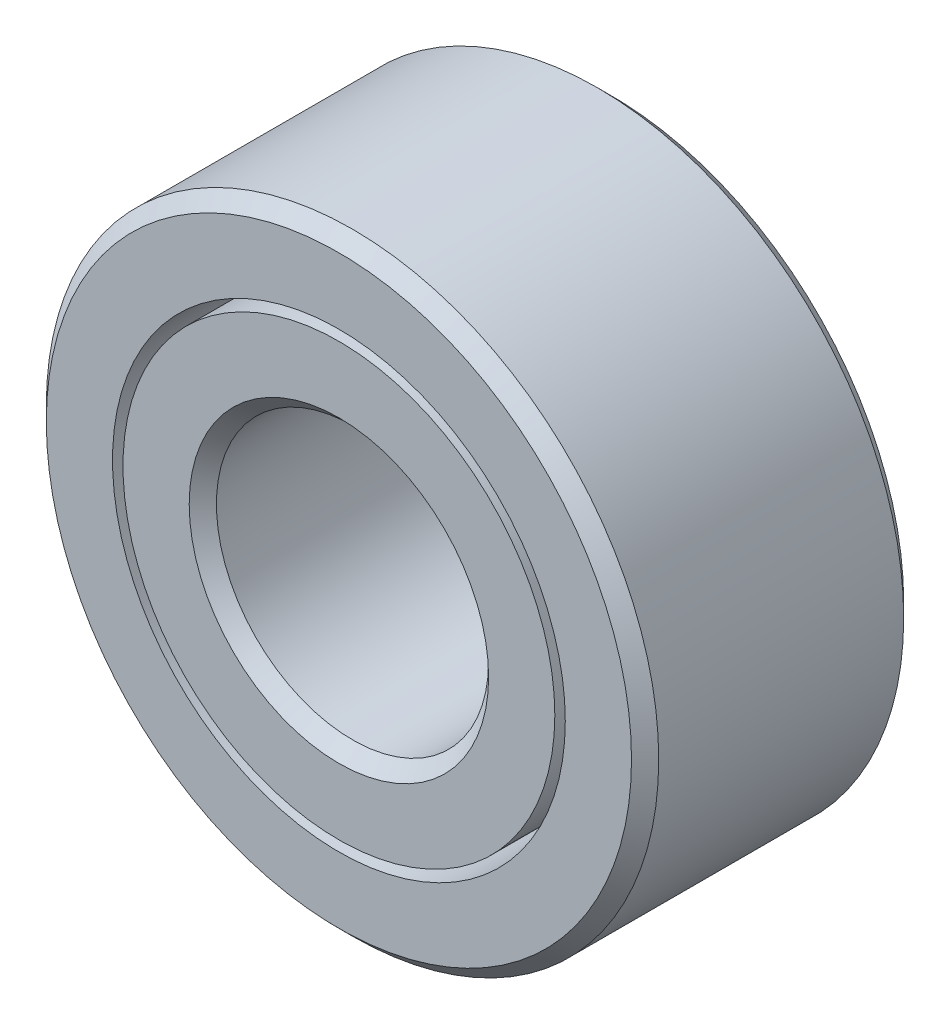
ISO-10303-21;
HEADER;
FILE_DESCRIPTION(('STEP AP214'),'2;1');
FILE_NAME('part.step','',(''),(''),'','','');
FILE_SCHEMA(('AUTOMOTIVE_DESIGN { 1 0 10303 214 1 1 1 1 }'));
ENDSEC;
DATA;
#1=APPLICATION_CONTEXT('core data for automotive mechanical design processes');
#2=APPLICATION_PROTOCOL_DEFINITION('international standard','automotive_design',2000,#1);
#3=PRODUCT_CONTEXT('',#1,'mechanical');
#4=PRODUCT('Part','Part','',(#3));
#5=PRODUCT_RELATED_PRODUCT_CATEGORY('part','',(#4));
#6=PRODUCT_DEFINITION_FORMATION('','',#4);
#7=PRODUCT_DEFINITION_CONTEXT('part definition',#1,'design');
#8=PRODUCT_DEFINITION('design','',#6,#7);
#9=PRODUCT_DEFINITION_SHAPE('','',#8);
#10=(LENGTH_UNIT() NAMED_UNIT(*) SI_UNIT(.MILLI.,.METRE.));
#11=(NAMED_UNIT(*) PLANE_ANGLE_UNIT() SI_UNIT($,.RADIAN.));
#12=(NAMED_UNIT(*) SI_UNIT($,.STERADIAN.) SOLID_ANGLE_UNIT());
#13=UNCERTAINTY_MEASURE_WITH_UNIT(LENGTH_MEASURE(1.E-05),#10,'distance_accuracy_value','');
#14=(GEOMETRIC_REPRESENTATION_CONTEXT(3) GLOBAL_UNCERTAINTY_ASSIGNED_CONTEXT((#13)) GLOBAL_UNIT_ASSIGNED_CONTEXT((#10,
#11,#12)) REPRESENTATION_CONTEXT('',''));
#15=CARTESIAN_POINT('',(0.,0.,0.));
#16=DIRECTION('',(0.,0.,1.));
#17=DIRECTION('',(1.,0.,0.));
#18=AXIS2_PLACEMENT_3D('',#15,#16,#17);
#19=CARTESIAN_POINT('',(-1.2437211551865,3.0026084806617,0.));
#20=DIRECTION('',(0.,0.,1.));
#21=DIRECTION('',(-0.382683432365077,0.923879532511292,0.));
#22=AXIS2_PLACEMENT_3D('',#19,#20,#21);
#23=SPHERICAL_SURFACE('',#22,0.5);
#24=CARTESIAN_POINT('',(-1.2437211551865,3.0026084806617,0.5));
#25=VERTEX_POINT('',#24);
#26=VERTEX_LOOP('',#25);
#27=FACE_BOUND('',#26,.T.);
#28=ADVANCED_FACE('F41',(#27),#23,.T.);
#29=CLOSED_SHELL('',(#28));
#30=MANIFOLD_SOLID_BREP('B2',#29);
#31=CARTESIAN_POINT('',(-2.29809703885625,2.29809703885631,0.));
#32=DIRECTION('',(0.,0.,1.));
#33=DIRECTION('',(-0.707106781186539,0.707106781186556,0.));
#34=AXIS2_PLACEMENT_3D('',#31,#32,#33);
#35=SPHERICAL_SURFACE('',#34,0.5);
#36=CARTESIAN_POINT('',(-2.29809703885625,2.29809703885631,0.5));
#37=VERTEX_POINT('',#36);
#38=VERTEX_LOOP('',#37);
#39=FACE_BOUND('',#38,.T.);
#40=ADVANCED_FACE('F61',(#39),#35,.T.);
#41=CLOSED_SHELL('',(#40));
#42=MANIFOLD_SOLID_BREP('B6',#41);
#43=CARTESIAN_POINT('',(-3.00260848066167,1.24372115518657,0.));
#44=DIRECTION('',(0.,0.,1.));
#45=DIRECTION('',(-0.923879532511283,0.3826834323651,0.));
#46=AXIS2_PLACEMENT_3D('',#43,#44,#45);
#47=SPHERICAL_SURFACE('',#46,0.5);
#48=CARTESIAN_POINT('',(-3.00260848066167,1.24372115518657,0.5));
#49=VERTEX_POINT('',#48);
#50=VERTEX_LOOP('',#49);
#51=FACE_BOUND('',#50,.T.);
#52=ADVANCED_FACE('F81',(#51),#47,.T.);
#53=CLOSED_SHELL('',(#52));
#54=MANIFOLD_SOLID_BREP('B37',#53);
#55=CARTESIAN_POINT('',(-3.25,0.,0.));
#56=DIRECTION('',(0.,0.,1.));
#57=DIRECTION('',(-1.,0.,0.));
#58=AXIS2_PLACEMENT_3D('',#55,#56,#57);
#59=SPHERICAL_SURFACE('',#58,0.5);
#60=CARTESIAN_POINT('',(-3.25,0.,0.5));
#61=VERTEX_POINT('',#60);
#62=VERTEX_LOOP('',#61);
#63=FACE_BOUND('',#62,.T.);
#64=ADVANCED_FACE('F101',(#63),#59,.T.);
#65=CLOSED_SHELL('',(#64));
#66=MANIFOLD_SOLID_BREP('B57',#65);
#67=CARTESIAN_POINT('',(-3.00260848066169,-1.24372115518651,0.));
#68=DIRECTION('',(0.,0.,1.));
#69=DIRECTION('',(-0.923879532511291,-0.382683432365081,0.));
#70=AXIS2_PLACEMENT_3D('',#67,#68,#69);
#71=SPHERICAL_SURFACE('',#70,0.5);
#72=CARTESIAN_POINT('',(-3.00260848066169,-1.24372115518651,0.5));
#73=VERTEX_POINT('',#72);
#74=VERTEX_LOOP('',#73);
#75=FACE_BOUND('',#74,.T.);
#76=ADVANCED_FACE('F121',(#75),#71,.T.);
#77=CLOSED_SHELL('',(#76));
#78=MANIFOLD_SOLID_BREP('B77',#77);
#79=CARTESIAN_POINT('',(-2.2980970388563,-2.29809703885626,0.));
#80=DIRECTION('',(0.,0.,1.));
#81=DIRECTION('',(-0.707106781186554,-0.707106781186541,0.));
#82=AXIS2_PLACEMENT_3D('',#79,#80,#81);
#83=SPHERICAL_SURFACE('',#82,0.5);
#84=CARTESIAN_POINT('',(-2.2980970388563,-2.29809703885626,0.5));
#85=VERTEX_POINT('',#84);
#86=VERTEX_LOOP('',#85);
#87=FACE_BOUND('',#86,.T.);
#88=ADVANCED_FACE('F141',(#87),#83,.T.);
#89=CLOSED_SHELL('',(#88));
#90=MANIFOLD_SOLID_BREP('B97',#89);
#91=CARTESIAN_POINT('',(-1.24372115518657,-3.00260848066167,0.));
#92=DIRECTION('',(0.,0.,1.));
#93=DIRECTION('',(-0.382683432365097,-0.923879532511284,0.));
#94=AXIS2_PLACEMENT_3D('',#91,#92,#93);
#95=SPHERICAL_SURFACE('',#94,0.5);
#96=CARTESIAN_POINT('',(-1.24372115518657,-3.00260848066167,0.5));
#97=VERTEX_POINT('',#96);
#98=VERTEX_LOOP('',#97);
#99=FACE_BOUND('',#98,.T.);
#100=ADVANCED_FACE('F161',(#99),#95,.T.);
#101=CLOSED_SHELL('',(#100));
#102=MANIFOLD_SOLID_BREP('B117',#101);
#103=CARTESIAN_POINT('',(0.,-3.25,0.));
#104=DIRECTION('',(0.,0.,1.));
#105=DIRECTION('',(0.,-1.,0.));
#106=AXIS2_PLACEMENT_3D('',#103,#104,#105);
#107=SPHERICAL_SURFACE('',#106,0.5);
#108=CARTESIAN_POINT('',(0.,-3.25,0.5));
#109=VERTEX_POINT('',#108);
#110=VERTEX_LOOP('',#109);
#111=FACE_BOUND('',#110,.T.);
#112=ADVANCED_FACE('F181',(#111),#107,.T.);
#113=CLOSED_SHELL('',(#112));
#114=MANIFOLD_SOLID_BREP('B137',#113);
#115=CARTESIAN_POINT('',(1.24372115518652,-3.00260848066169,0.));
#116=DIRECTION('',(0.,0.,1.));
#117=DIRECTION('',(0.382683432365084,-0.923879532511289,0.));
#118=AXIS2_PLACEMENT_3D('',#115,#116,#117);
#119=SPHERICAL_SURFACE('',#118,0.5);
#120=CARTESIAN_POINT('',(1.24372115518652,-3.00260848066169,0.5));
#121=VERTEX_POINT('',#120);
#122=VERTEX_LOOP('',#121);
#123=FACE_BOUND('',#122,.T.);
#124=ADVANCED_FACE('F201',(#123),#119,.T.);
#125=CLOSED_SHELL('',(#124));
#126=MANIFOLD_SOLID_BREP('B157',#125);
#127=CARTESIAN_POINT('',(2.29809703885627,-2.29809703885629,0.));
#128=DIRECTION('',(0.,0.,1.));
#129=DIRECTION('',(0.707106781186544,-0.707106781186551,0.));
#130=AXIS2_PLACEMENT_3D('',#127,#128,#129);
#131=SPHERICAL_SURFACE('',#130,0.5);
#132=CARTESIAN_POINT('',(2.29809703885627,-2.29809703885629,0.5));
#133=VERTEX_POINT('',#132);
#134=VERTEX_LOOP('',#133);
#135=FACE_BOUND('',#134,.T.);
#136=ADVANCED_FACE('F221',(#135),#131,.T.);
#137=CLOSED_SHELL('',(#136));
#138=MANIFOLD_SOLID_BREP('B177',#137);
#139=CARTESIAN_POINT('',(3.00260848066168,-1.24372115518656,0.));
#140=DIRECTION('',(0.,0.,1.));
#141=DIRECTION('',(0.923879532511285,-0.382683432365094,0.));
#142=AXIS2_PLACEMENT_3D('',#139,#140,#141);
#143=SPHERICAL_SURFACE('',#142,0.5);
#144=CARTESIAN_POINT('',(3.00260848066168,-1.24372115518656,0.5));
#145=VERTEX_POINT('',#144);
#146=VERTEX_LOOP('',#145);
#147=FACE_BOUND('',#146,.T.);
#148=ADVANCED_FACE('F241',(#147),#143,.T.);
#149=CLOSED_SHELL('',(#148));
#150=MANIFOLD_SOLID_BREP('B197',#149);
#151=CARTESIAN_POINT('',(3.25,0.,0.));
#152=DIRECTION('',(0.,0.,1.));
#153=DIRECTION('',(1.,0.,0.));
#154=AXIS2_PLACEMENT_3D('',#151,#152,#153);
#155=SPHERICAL_SURFACE('',#154,0.5);
#156=CARTESIAN_POINT('',(3.25,0.,0.5));
#157=VERTEX_POINT('',#156);
#158=VERTEX_LOOP('',#157);
#159=FACE_BOUND('',#158,.T.);
#160=ADVANCED_FACE('F261',(#159),#155,.T.);
#161=CLOSED_SHELL('',(#160));
#162=MANIFOLD_SOLID_BREP('B217',#161);
#163=CARTESIAN_POINT('',(3.00260848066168,1.24372115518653,0.));
#164=DIRECTION('',(0.,0.,1.));
#165=DIRECTION('',(0.923879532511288,0.382683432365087,0.));
#166=AXIS2_PLACEMENT_3D('',#163,#164,#165);
#167=SPHERICAL_SURFACE('',#166,0.5);
#168=CARTESIAN_POINT('',(3.00260848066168,1.24372115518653,0.5));
#169=VERTEX_POINT('',#168);
#170=VERTEX_LOOP('',#169);
#171=FACE_BOUND('',#170,.T.);
#172=ADVANCED_FACE('F281',(#171),#167,.T.);
#173=CLOSED_SHELL('',(#172));
#174=MANIFOLD_SOLID_BREP('B237',#173);
#175=CARTESIAN_POINT('',(2.29809703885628,2.29809703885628,0.));
#176=DIRECTION('',(0.,0.,1.));
#177=DIRECTION('',(0.707106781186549,0.707106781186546,0.));
#178=AXIS2_PLACEMENT_3D('',#175,#176,#177);
#179=SPHERICAL_SURFACE('',#178,0.5);
#180=CARTESIAN_POINT('',(2.29809703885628,2.29809703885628,0.5));
#181=VERTEX_POINT('',#180);
#182=VERTEX_LOOP('',#181);
#183=FACE_BOUND('',#182,.T.);
#184=ADVANCED_FACE('F301',(#183),#179,.T.);
#185=CLOSED_SHELL('',(#184));
#186=MANIFOLD_SOLID_BREP('B257',#185);
#187=CARTESIAN_POINT('',(1.24372115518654,3.00260848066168,0.));
#188=DIRECTION('',(0.,0.,1.));
#189=DIRECTION('',(0.382683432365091,0.923879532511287,0.));
#190=AXIS2_PLACEMENT_3D('',#187,#188,#189);
#191=SPHERICAL_SURFACE('',#190,0.5);
#192=CARTESIAN_POINT('',(1.24372115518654,3.00260848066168,0.5));
#193=VERTEX_POINT('',#192);
#194=VERTEX_LOOP('',#193);
#195=FACE_BOUND('',#194,.T.);
#196=ADVANCED_FACE('F321',(#195),#191,.T.);
#197=CLOSED_SHELL('',(#196));
#198=MANIFOLD_SOLID_BREP('B277',#197);
#199=CARTESIAN_POINT('',(0.,3.25,0.));
#200=DIRECTION('',(0.,0.,1.));
#201=DIRECTION('',(0.,1.,0.));
#202=AXIS2_PLACEMENT_3D('',#199,#200,#201);
#203=SPHERICAL_SURFACE('',#202,0.5);
#204=CARTESIAN_POINT('',(0.,3.25,0.5));
#205=VERTEX_POINT('',#204);
#206=VERTEX_LOOP('',#205);
#207=FACE_BOUND('',#206,.T.);
#208=ADVANCED_FACE('F343',(#207),#203,.T.);
#209=CLOSED_SHELL('',(#208));
#210=MANIFOLD_SOLID_BREP('B297',#209);
#211=CARTESIAN_POINT('',(0.,3.17307692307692,2.));
#212=DIRECTION('',(0.,0.,-1.));
#213=DIRECTION('',(-1.,0.,0.));
#214=AXIS2_PLACEMENT_3D('',#211,#212,#213);
#215=PLANE('',#214);
#216=CARTESIAN_POINT('',(0.,0.,2.));
#217=DIRECTION('',(0.,0.,1.));
#218=DIRECTION('',(1.,0.,0.));
#219=AXIS2_PLACEMENT_3D('',#216,#217,#218);
#220=CIRCLE('',#219,2.2);
#221=CARTESIAN_POINT('',(2.2,0.,2.));
#222=VERTEX_POINT('',#221);
#223=EDGE_CURVE('E390',#222,#222,#220,.T.);
#224=ORIENTED_EDGE('',*,*,#223,.F.);
#225=EDGE_LOOP('',(#224));
#226=FACE_BOUND('',#225,.T.);
#227=CARTESIAN_POINT('',(0.,0.,2.));
#228=DIRECTION('',(0.,0.,1.));
#229=DIRECTION('',(1.,0.,0.));
#230=AXIS2_PLACEMENT_3D('',#227,#228,#229);
#231=CIRCLE('',#230,3.17307692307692);
#232=CARTESIAN_POINT('',(3.17307692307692,0.,2.));
#233=VERTEX_POINT('',#232);
#234=EDGE_CURVE('E342',#233,#233,#231,.T.);
#235=ORIENTED_EDGE('',*,*,#234,.T.);
#236=EDGE_LOOP('',(#235));
#237=FACE_BOUND('',#236,.T.);
#238=ADVANCED_FACE('F362',(#226,#237),#215,.F.);
#239=CARTESIAN_POINT('',(0.,0.,2.));
#240=DIRECTION('',(0.,0.,1.));
#241=DIRECTION('',(1.,0.,0.));
#242=AXIS2_PLACEMENT_3D('',#239,#240,#241);
#243=CYLINDRICAL_SURFACE('',#242,3.17307692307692);
#244=ORIENTED_EDGE('',*,*,#234,.F.);
#245=EDGE_LOOP('',(#244));
#246=FACE_BOUND('',#245,.T.);
#247=CARTESIAN_POINT('',(0.,0.,0.494047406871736));
#248=DIRECTION('',(0.,0.,1.));
#249=DIRECTION('',(1.,0.,0.));
#250=AXIS2_PLACEMENT_3D('',#247,#248,#249);
#251=CIRCLE('',#250,3.17307692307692);
#252=CARTESIAN_POINT('',(3.17307692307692,0.,0.494047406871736));
#253=VERTEX_POINT('',#252);
#254=EDGE_CURVE('E368',#253,#253,#251,.T.);
#255=ORIENTED_EDGE('',*,*,#254,.T.);
#256=EDGE_LOOP('',(#255));
#257=FACE_BOUND('',#256,.T.);
#258=ADVANCED_FACE('F397',(#246,#257),#243,.T.);
#259=CARTESIAN_POINT('',(0.,0.,0.));
#260=DIRECTION('',(0.,0.,1.));
#261=DIRECTION('',(1.,0.,0.));
#262=AXIS2_PLACEMENT_3D('',#259,#260,#261);
#263=TOROIDAL_SURFACE('',#262,3.25,0.5);
#264=ORIENTED_EDGE('',*,*,#254,.F.);
#265=EDGE_LOOP('',(#264));
#266=FACE_BOUND('',#265,.T.);
#267=CARTESIAN_POINT('',(0.,0.,-0.494047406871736));
#268=DIRECTION('',(0.,0.,1.));
#269=DIRECTION('',(1.,0.,0.));
#270=AXIS2_PLACEMENT_3D('',#267,#268,#269);
#271=CIRCLE('',#270,3.17307692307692);
#272=CARTESIAN_POINT('',(3.17307692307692,0.,-0.494047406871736));
#273=VERTEX_POINT('',#272);
#274=EDGE_CURVE('E372',#273,#273,#271,.T.);
#275=ORIENTED_EDGE('',*,*,#274,.T.);
#276=EDGE_LOOP('',(#275));
#277=FACE_BOUND('',#276,.T.);
#278=ADVANCED_FACE('F401',(#266,#277),#263,.F.);
#279=CARTESIAN_POINT('',(0.,0.,2.));
#280=DIRECTION('',(0.,0.,1.));
#281=DIRECTION('',(1.,0.,0.));
#282=AXIS2_PLACEMENT_3D('',#279,#280,#281);
#283=CYLINDRICAL_SURFACE('',#282,3.17307692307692);
#284=ORIENTED_EDGE('',*,*,#274,.F.);
#285=EDGE_LOOP('',(#284));
#286=FACE_BOUND('',#285,.T.);
#287=CARTESIAN_POINT('',(0.,0.,-2.));
#288=DIRECTION('',(0.,0.,1.));
#289=DIRECTION('',(1.,0.,0.));
#290=AXIS2_PLACEMENT_3D('',#287,#288,#289);
#291=CIRCLE('',#290,3.17307692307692);
#292=CARTESIAN_POINT('',(3.17307692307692,0.,-2.));
#293=VERTEX_POINT('',#292);
#294=EDGE_CURVE('E376',#293,#293,#291,.T.);
#295=ORIENTED_EDGE('',*,*,#294,.T.);
#296=EDGE_LOOP('',(#295));
#297=FACE_BOUND('',#296,.T.);
#298=ADVANCED_FACE('F406',(#286,#297),#283,.T.);
#299=CARTESIAN_POINT('',(0.,2.2,-2.));
#300=DIRECTION('',(0.,0.,1.));
#301=DIRECTION('',(1.,0.,0.));
#302=AXIS2_PLACEMENT_3D('',#299,#300,#301);
#303=PLANE('',#302);
#304=ORIENTED_EDGE('',*,*,#294,.F.);
#305=EDGE_LOOP('',(#304));
#306=FACE_BOUND('',#305,.T.);
#307=CARTESIAN_POINT('',(0.,0.,-2.));
#308=DIRECTION('',(0.,0.,1.));
#309=DIRECTION('',(1.,0.,0.));
#310=AXIS2_PLACEMENT_3D('',#307,#308,#309);
#311=CIRCLE('',#310,2.2);
#312=CARTESIAN_POINT('',(2.2,0.,-2.));
#313=VERTEX_POINT('',#312);
#314=EDGE_CURVE('E381',#313,#313,#311,.T.);
#315=ORIENTED_EDGE('',*,*,#314,.T.);
#316=EDGE_LOOP('',(#315));
#317=FACE_BOUND('',#316,.T.);
#318=ADVANCED_FACE('F412',(#306,#317),#303,.F.);
#319=CARTESIAN_POINT('',(0.,0.,-1.8));
#320=DIRECTION('',(0.,0.,-1.));
#321=DIRECTION('',(-1.,0.,0.));
#322=AXIS2_PLACEMENT_3D('',#319,#320,#321);
#323=CONICAL_SURFACE('',#322,2.,0.785398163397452);
#324=ORIENTED_EDGE('',*,*,#314,.F.);
#325=EDGE_LOOP('',(#324));
#326=FACE_BOUND('',#325,.T.);
#327=CARTESIAN_POINT('',(0.,0.,-1.8));
#328=DIRECTION('',(0.,0.,1.));
#329=DIRECTION('',(1.,0.,0.));
#330=AXIS2_PLACEMENT_3D('',#327,#328,#329);
#331=CIRCLE('',#330,2.);
#332=CARTESIAN_POINT('',(2.,0.,-1.8));
#333=VERTEX_POINT('',#332);
#334=EDGE_CURVE('E384',#333,#333,#331,.T.);
#335=ORIENTED_EDGE('',*,*,#334,.T.);
#336=EDGE_LOOP('',(#335));
#337=FACE_BOUND('',#336,.T.);
#338=ADVANCED_FACE('F416',(#326,#337),#323,.F.);
#339=CARTESIAN_POINT('',(0.,0.,2.));
#340=DIRECTION('',(0.,0.,1.));
#341=DIRECTION('',(1.,0.,0.));
#342=AXIS2_PLACEMENT_3D('',#339,#340,#341);
#343=CYLINDRICAL_SURFACE('',#342,2.);
#344=ORIENTED_EDGE('',*,*,#334,.F.);
#345=EDGE_LOOP('',(#344));
#346=FACE_BOUND('',#345,.T.);
#347=CARTESIAN_POINT('',(0.,0.,1.8));
#348=DIRECTION('',(0.,0.,1.));
#349=DIRECTION('',(1.,0.,0.));
#350=AXIS2_PLACEMENT_3D('',#347,#348,#349);
#351=CIRCLE('',#350,2.);
#352=CARTESIAN_POINT('',(2.,0.,1.8));
#353=VERTEX_POINT('',#352);
#354=EDGE_CURVE('E387',#353,#353,#351,.T.);
#355=ORIENTED_EDGE('',*,*,#354,.T.);
#356=EDGE_LOOP('',(#355));
#357=FACE_BOUND('',#356,.T.);
#358=ADVANCED_FACE('F420',(#346,#357),#343,.F.);
#359=CARTESIAN_POINT('',(0.,0.,2.));
#360=DIRECTION('',(0.,0.,1.));
#361=DIRECTION('',(1.,0.,0.));
#362=AXIS2_PLACEMENT_3D('',#359,#360,#361);
#363=CONICAL_SURFACE('',#362,2.2,0.785398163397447);
#364=ORIENTED_EDGE('',*,*,#354,.F.);
#365=EDGE_LOOP('',(#364));
#366=FACE_BOUND('',#365,.T.);
#367=ORIENTED_EDGE('',*,*,#223,.T.);
#368=EDGE_LOOP('',(#367));
#369=FACE_BOUND('',#368,.T.);
#370=ADVANCED_FACE('F394',(#366,#369),#363,.F.);
#371=CLOSED_SHELL('',(#238,#258,#278,#298,#318,#338,#358,#370));
#372=MANIFOLD_SOLID_BREP('B317',#371);
#373=CARTESIAN_POINT('',(0.,0.,1.8));
#374=DIRECTION('',(0.,0.,-1.));
#375=DIRECTION('',(-1.,0.,0.));
#376=AXIS2_PLACEMENT_3D('',#373,#374,#375);
#377=CONICAL_SURFACE('',#376,4.5,0.78539816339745);
#378=CARTESIAN_POINT('',(0.,0.,2.));
#379=DIRECTION('',(0.,0.,1.));
#380=DIRECTION('',(1.,0.,0.));
#381=AXIS2_PLACEMENT_3D('',#378,#379,#380);
#382=CIRCLE('',#381,4.3);
#383=CARTESIAN_POINT('',(4.3,0.,2.));
#384=VERTEX_POINT('',#383);
#385=EDGE_CURVE('E526',#384,#384,#382,.T.);
#386=ORIENTED_EDGE('',*,*,#385,.F.);
#387=EDGE_LOOP('',(#386));
#388=FACE_BOUND('',#387,.T.);
#389=CARTESIAN_POINT('',(0.,0.,1.8));
#390=DIRECTION('',(0.,0.,1.));
#391=DIRECTION('',(1.,0.,0.));
#392=AXIS2_PLACEMENT_3D('',#389,#390,#391);
#393=CIRCLE('',#392,4.5);
#394=CARTESIAN_POINT('',(4.5,0.,1.8));
#395=VERTEX_POINT('',#394);
#396=EDGE_CURVE('E361',#395,#395,#393,.T.);
#397=ORIENTED_EDGE('',*,*,#396,.T.);
#398=EDGE_LOOP('',(#397));
#399=FACE_BOUND('',#398,.T.);
#400=ADVANCED_FACE('F498',(#388,#399),#377,.T.);
#401=CARTESIAN_POINT('',(0.,0.,2.));
#402=DIRECTION('',(0.,0.,1.));
#403=DIRECTION('',(1.,0.,0.));
#404=AXIS2_PLACEMENT_3D('',#401,#402,#403);
#405=CYLINDRICAL_SURFACE('',#404,4.5);
#406=ORIENTED_EDGE('',*,*,#396,.F.);
#407=EDGE_LOOP('',(#406));
#408=FACE_BOUND('',#407,.T.);
#409=CARTESIAN_POINT('',(0.,0.,-1.8));
#410=DIRECTION('',(0.,0.,1.));
#411=DIRECTION('',(1.,0.,0.));
#412=AXIS2_PLACEMENT_3D('',#409,#410,#411);
#413=CIRCLE('',#412,4.5);
#414=CARTESIAN_POINT('',(4.5,0.,-1.8));
#415=VERTEX_POINT('',#414);
#416=EDGE_CURVE('E504',#415,#415,#413,.T.);
#417=ORIENTED_EDGE('',*,*,#416,.T.);
#418=EDGE_LOOP('',(#417));
#419=FACE_BOUND('',#418,.T.);
#420=ADVANCED_FACE('F533',(#408,#419),#405,.T.);
#421=CARTESIAN_POINT('',(0.,0.,-2.));
#422=DIRECTION('',(0.,0.,1.));
#423=DIRECTION('',(1.,0.,0.));
#424=AXIS2_PLACEMENT_3D('',#421,#422,#423);
#425=CONICAL_SURFACE('',#424,4.3,0.785398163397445);
#426=ORIENTED_EDGE('',*,*,#416,.F.);
#427=EDGE_LOOP('',(#426));
#428=FACE_BOUND('',#427,.T.);
#429=CARTESIAN_POINT('',(0.,0.,-2.));
#430=DIRECTION('',(0.,0.,1.));
#431=DIRECTION('',(1.,0.,0.));
#432=AXIS2_PLACEMENT_3D('',#429,#430,#431);
#433=CIRCLE('',#432,4.3);
#434=CARTESIAN_POINT('',(4.3,0.,-2.));
#435=VERTEX_POINT('',#434);
#436=EDGE_CURVE('E508',#435,#435,#433,.T.);
#437=ORIENTED_EDGE('',*,*,#436,.T.);
#438=EDGE_LOOP('',(#437));
#439=FACE_BOUND('',#438,.T.);
#440=ADVANCED_FACE('F537',(#428,#439),#425,.T.);
#441=CARTESIAN_POINT('',(0.,4.3,-2.));
#442=DIRECTION('',(0.,0.,1.));
#443=DIRECTION('',(1.,0.,0.));
#444=AXIS2_PLACEMENT_3D('',#441,#442,#443);
#445=PLANE('',#444);
#446=ORIENTED_EDGE('',*,*,#436,.F.);
#447=EDGE_LOOP('',(#446));
#448=FACE_BOUND('',#447,.T.);
#449=CARTESIAN_POINT('',(0.,0.,-2.));
#450=DIRECTION('',(0.,0.,1.));
#451=DIRECTION('',(1.,0.,0.));
#452=AXIS2_PLACEMENT_3D('',#449,#450,#451);
#453=CIRCLE('',#452,3.32692307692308);
#454=CARTESIAN_POINT('',(3.32692307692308,0.,-2.));
#455=VERTEX_POINT('',#454);
#456=EDGE_CURVE('E512',#455,#455,#453,.T.);
#457=ORIENTED_EDGE('',*,*,#456,.T.);
#458=EDGE_LOOP('',(#457));
#459=FACE_BOUND('',#458,.T.);
#460=ADVANCED_FACE('F542',(#448,#459),#445,.F.);
#461=CARTESIAN_POINT('',(0.,0.,2.));
#462=DIRECTION('',(0.,0.,1.));
#463=DIRECTION('',(1.,0.,0.));
#464=AXIS2_PLACEMENT_3D('',#461,#462,#463);
#465=CYLINDRICAL_SURFACE('',#464,3.32692307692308);
#466=ORIENTED_EDGE('',*,*,#456,.F.);
#467=EDGE_LOOP('',(#466));
#468=FACE_BOUND('',#467,.T.);
#469=CARTESIAN_POINT('',(0.,0.,-0.494047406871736));
#470=DIRECTION('',(0.,0.,1.));
#471=DIRECTION('',(1.,0.,0.));
#472=AXIS2_PLACEMENT_3D('',#469,#470,#471);
#473=CIRCLE('',#472,3.32692307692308);
#474=CARTESIAN_POINT('',(3.32692307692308,0.,-0.494047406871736));
#475=VERTEX_POINT('',#474);
#476=EDGE_CURVE('E517',#475,#475,#473,.T.);
#477=ORIENTED_EDGE('',*,*,#476,.T.);
#478=EDGE_LOOP('',(#477));
#479=FACE_BOUND('',#478,.T.);
#480=ADVANCED_FACE('F548',(#468,#479),#465,.F.);
#481=CARTESIAN_POINT('',(0.,0.,0.));
#482=DIRECTION('',(0.,0.,1.));
#483=DIRECTION('',(1.,0.,0.));
#484=AXIS2_PLACEMENT_3D('',#481,#482,#483);
#485=TOROIDAL_SURFACE('',#484,3.25,0.5);
#486=ORIENTED_EDGE('',*,*,#476,.F.);
#487=EDGE_LOOP('',(#486));
#488=FACE_BOUND('',#487,.T.);
#489=CARTESIAN_POINT('',(0.,0.,0.494047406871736));
#490=DIRECTION('',(0.,0.,1.));
#491=DIRECTION('',(1.,0.,0.));
#492=AXIS2_PLACEMENT_3D('',#489,#490,#491);
#493=CIRCLE('',#492,3.32692307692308);
#494=CARTESIAN_POINT('',(3.32692307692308,0.,0.494047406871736));
#495=VERTEX_POINT('',#494);
#496=EDGE_CURVE('E520',#495,#495,#493,.T.);
#497=ORIENTED_EDGE('',*,*,#496,.T.);
#498=EDGE_LOOP('',(#497));
#499=FACE_BOUND('',#498,.T.);
#500=ADVANCED_FACE('F552',(#488,#499),#485,.F.);
#501=CARTESIAN_POINT('',(0.,0.,2.));
#502=DIRECTION('',(0.,0.,1.));
#503=DIRECTION('',(1.,0.,0.));
#504=AXIS2_PLACEMENT_3D('',#501,#502,#503);
#505=CYLINDRICAL_SURFACE('',#504,3.32692307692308);
#506=ORIENTED_EDGE('',*,*,#496,.F.);
#507=EDGE_LOOP('',(#506));
#508=FACE_BOUND('',#507,.T.);
#509=CARTESIAN_POINT('',(0.,0.,2.));
#510=DIRECTION('',(0.,0.,1.));
#511=DIRECTION('',(1.,0.,0.));
#512=AXIS2_PLACEMENT_3D('',#509,#510,#511);
#513=CIRCLE('',#512,3.32692307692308);
#514=CARTESIAN_POINT('',(3.32692307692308,0.,2.));
#515=VERTEX_POINT('',#514);
#516=EDGE_CURVE('E523',#515,#515,#513,.T.);
#517=ORIENTED_EDGE('',*,*,#516,.T.);
#518=EDGE_LOOP('',(#517));
#519=FACE_BOUND('',#518,.T.);
#520=ADVANCED_FACE('F556',(#508,#519),#505,.F.);
#521=CARTESIAN_POINT('',(0.,4.3,2.));
#522=DIRECTION('',(0.,0.,-1.));
#523=DIRECTION('',(-1.,0.,0.));
#524=AXIS2_PLACEMENT_3D('',#521,#522,#523);
#525=PLANE('',#524);
#526=ORIENTED_EDGE('',*,*,#516,.F.);
#527=EDGE_LOOP('',(#526));
#528=FACE_BOUND('',#527,.T.);
#529=ORIENTED_EDGE('',*,*,#385,.T.);
#530=EDGE_LOOP('',(#529));
#531=FACE_BOUND('',#530,.T.);
#532=ADVANCED_FACE('F530',(#528,#531),#525,.F.);
#533=CLOSED_SHELL('',(#400,#420,#440,#460,#480,#500,#520,#532));
#534=MANIFOLD_SOLID_BREP('B337',#533);
#535=ADVANCED_BREP_SHAPE_REPRESENTATION('',(#18,#30,#42,#54,#66,#78,#90,#102,#114,#126,#138,
#150,#162,#174,#186,#198,#210,#372,#534),#14);
#536=SHAPE_DEFINITION_REPRESENTATION(#9,#535);
ENDSEC;
END-ISO-10303-21;
